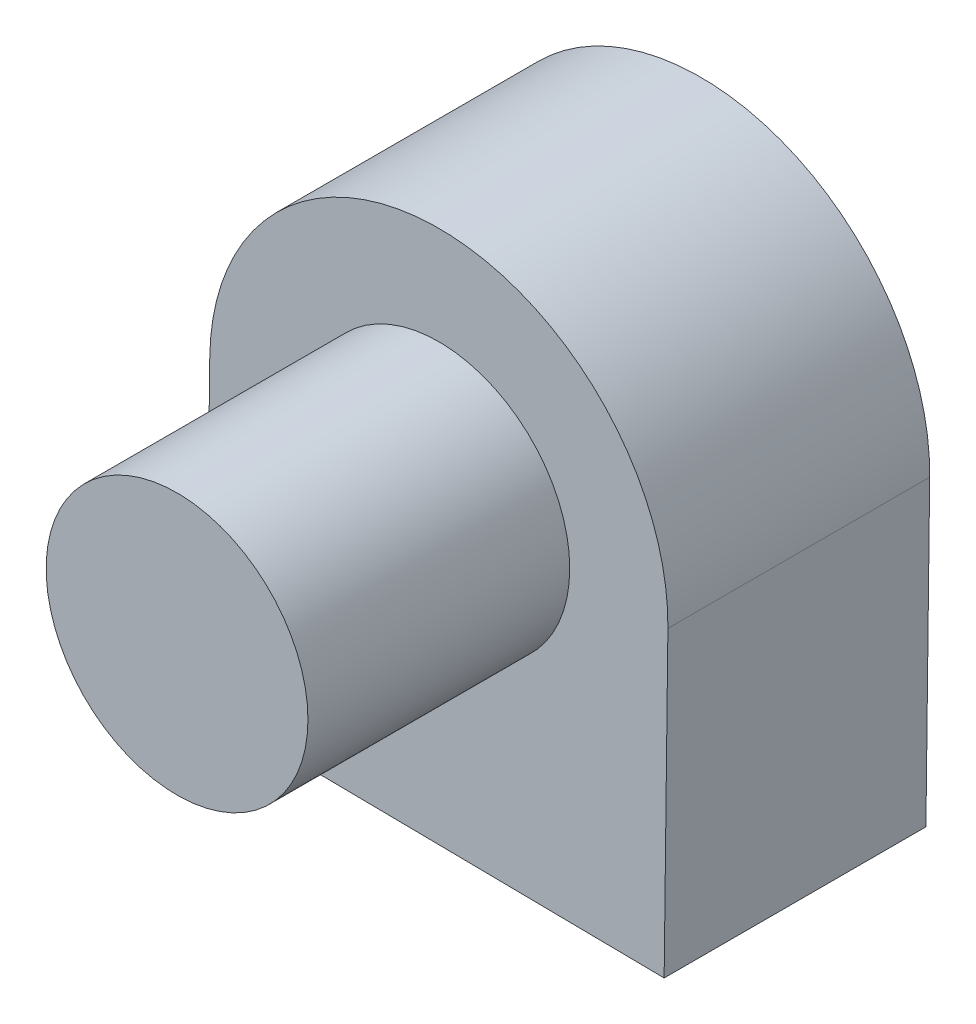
ISO-10303-21;
HEADER;
FILE_DESCRIPTION(('STEP AP214'),'2;1');
FILE_NAME('part.step','',(''),(''),'','','');
FILE_SCHEMA(('AUTOMOTIVE_DESIGN { 1 0 10303 214 1 1 1 1 }'));
ENDSEC;
DATA;
#1=APPLICATION_CONTEXT('core data for automotive mechanical design processes');
#2=APPLICATION_PROTOCOL_DEFINITION('international standard','automotive_design',2000,#1);
#3=PRODUCT_CONTEXT('',#1,'mechanical');
#4=PRODUCT('Part','Part','',(#3));
#5=PRODUCT_RELATED_PRODUCT_CATEGORY('part','',(#4));
#6=PRODUCT_DEFINITION_FORMATION('','',#4);
#7=PRODUCT_DEFINITION_CONTEXT('part definition',#1,'design');
#8=PRODUCT_DEFINITION('design','',#6,#7);
#9=PRODUCT_DEFINITION_SHAPE('','',#8);
#10=(LENGTH_UNIT() NAMED_UNIT(*) SI_UNIT(.MILLI.,.METRE.));
#11=(NAMED_UNIT(*) PLANE_ANGLE_UNIT() SI_UNIT($,.RADIAN.));
#12=(NAMED_UNIT(*) SI_UNIT($,.STERADIAN.) SOLID_ANGLE_UNIT());
#13=UNCERTAINTY_MEASURE_WITH_UNIT(LENGTH_MEASURE(1.E-05),#10,'distance_accuracy_value','');
#14=(GEOMETRIC_REPRESENTATION_CONTEXT(3) GLOBAL_UNCERTAINTY_ASSIGNED_CONTEXT((#13)) GLOBAL_UNIT_ASSIGNED_CONTEXT((#10,
#11,#12)) REPRESENTATION_CONTEXT('',''));
#15=CARTESIAN_POINT('',(0.,0.,0.));
#16=DIRECTION('',(0.,0.,1.));
#17=DIRECTION('',(1.,0.,0.));
#18=AXIS2_PLACEMENT_3D('',#15,#16,#17);
#19=CARTESIAN_POINT('',(13077.3616022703,5712.86470344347,-60.9728075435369));
#20=DIRECTION('',(4.96598459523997E-05,2.97959339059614E-06,0.999999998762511));
#21=DIRECTION('',(0.99999999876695,0.,-4.96598459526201E-05));
#22=AXIS2_PLACEMENT_3D('',#19,#20,#21);
#23=PLANE('',#22);
#24=DIRECTION('',(0.0123569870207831,0.999923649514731,-3.59301197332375E-06));
#25=VECTOR('',#24,1.);
#26=CARTESIAN_POINT('',(13076.9962605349,5683.30136079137,-60.9727013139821));
#27=LINE('',#26,#25);
#28=CARTESIAN_POINT('',(13076.9962605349,5683.30136079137,-60.9727013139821));
#29=VERTEX_POINT('',#28);
#30=CARTESIAN_POINT('',(13077.3616022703,5712.86470344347,-60.9728075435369));
#31=VERTEX_POINT('',#30);
#32=EDGE_CURVE('E70',#29,#31,#27,.T.);
#33=ORIENTED_EDGE('',*,*,#32,.F.);
#34=DIRECTION('',(0.999923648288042,-0.0123569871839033,-4.9619235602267E-05));
#35=VECTOR('',#34,1.);
#36=CARTESIAN_POINT('',(13032.5496543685,5683.8506288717,-60.9704957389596));
#37=LINE('',#36,#35);
#38=CARTESIAN_POINT('',(13032.5496543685,5683.8506288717,-60.9704957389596));
#39=VERTEX_POINT('',#38);
#40=EDGE_CURVE('E58',#39,#29,#37,.T.);
#41=ORIENTED_EDGE('',*,*,#40,.F.);
#42=DIRECTION('',(-0.012356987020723,-0.999923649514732,3.59301197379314E-06));
#43=VECTOR('',#42,1.);
#44=CARTESIAN_POINT('',(13032.9149961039,5713.41397152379,-60.9706019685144));
#45=LINE('',#44,#43);
#46=CARTESIAN_POINT('',(13032.9149961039,5713.41397152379,-60.9706019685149));
#47=VERTEX_POINT('',#46);
#48=EDGE_CURVE('E55',#47,#39,#45,.T.);
#49=ORIENTED_EDGE('',*,*,#48,.F.);
#50=CARTESIAN_POINT('',(13055.1382991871,5713.13933748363,-60.9717047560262));
#51=DIRECTION('',(-4.96598459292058E-05,-2.97959340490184E-06,-0.999999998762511));
#52=DIRECTION('',(-0.99999999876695,0.,4.96598459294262E-05));
#53=AXIS2_PLACEMENT_3D('',#50,#51,#52);
#54=CIRCLE('',#53,22.2249999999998);
#55=EDGE_CURVE('E18',#31,#47,#54,.F.);
#56=ORIENTED_EDGE('',*,*,#55,.F.);
#57=EDGE_LOOP('',(#33,#41,#49,#56));
#58=FACE_BOUND('',#57,.T.);
#59=ADVANCED_FACE('F14',(#58),#23,.F.);
#60=CARTESIAN_POINT('',(13032.915626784,5713.41400936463,-48.2706019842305));
#61=DIRECTION('',(-0.999923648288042,0.0123569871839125,4.96192356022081E-05));
#62=DIRECTION('',(-0.0123569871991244,-0.999923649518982,0.));
#63=AXIS2_PLACEMENT_3D('',#60,#61,#62);
#64=PLANE('',#63);
#65=DIRECTION('',(0.0123569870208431,0.99992364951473,-3.59301197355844E-06));
#66=VECTOR('',#65,1.);
#67=CARTESIAN_POINT('',(13032.5509157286,5683.85070455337,-35.5704957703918));
#68=LINE('',#67,#66);
#69=CARTESIAN_POINT('',(13032.5509157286,5683.85070455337,-35.5704957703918));
#70=VERTEX_POINT('',#69);
#71=CARTESIAN_POINT('',(13032.916257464,5713.41404720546,-35.5706019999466));
#72=VERTEX_POINT('',#71);
#73=EDGE_CURVE('E67',#70,#72,#68,.T.);
#74=ORIENTED_EDGE('',*,*,#73,.T.);
#75=DIRECTION('',(-4.96598459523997E-05,-2.97959339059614E-06,-0.999999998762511));
#76=VECTOR('',#75,1.);
#77=CARTESIAN_POINT('',(13032.915626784,5713.41400936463,-48.2706019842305));
#78=LINE('',#77,#76);
#79=EDGE_CURVE('E64',#47,#72,#78,.F.);
#80=ORIENTED_EDGE('',*,*,#79,.F.);
#81=ORIENTED_EDGE('',*,*,#48,.T.);
#82=DIRECTION('',(-4.96598458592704E-05,-2.97959340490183E-06,-0.999999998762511));
#83=VECTOR('',#82,1.);
#84=CARTESIAN_POINT('',(13032.5509157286,5683.85070455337,-35.5704957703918));
#85=LINE('',#84,#83);
#86=EDGE_CURVE('E89',#70,#39,#85,.T.);
#87=ORIENTED_EDGE('',*,*,#86,.F.);
#88=EDGE_LOOP('',(#74,#80,#81,#87));
#89=FACE_BOUND('',#88,.T.);
#90=ADVANCED_FACE('F65',(#89),#64,.T.);
#91=CARTESIAN_POINT('',(13055.1395605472,5713.1394131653,-35.5717047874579));
#92=DIRECTION('',(-4.96598459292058E-05,-2.97959340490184E-06,-0.999999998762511));
#93=DIRECTION('',(-0.99999999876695,0.,4.96598459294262E-05));
#94=AXIS2_PLACEMENT_3D('',#91,#92,#93);
#95=CYLINDRICAL_SURFACE('',#94,22.2249999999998);
#96=CARTESIAN_POINT('',(13055.1395605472,5713.1394131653,-35.5717047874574));
#97=DIRECTION('',(-4.96598459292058E-05,-2.97959340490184E-06,-0.999999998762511));
#98=DIRECTION('',(-0.99999999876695,0.,4.96598459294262E-05));
#99=AXIS2_PLACEMENT_3D('',#96,#97,#98);
#100=CIRCLE('',#99,22.2249999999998);
#101=CARTESIAN_POINT('',(13077.3628636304,5712.86477912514,-35.5728075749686));
#102=VERTEX_POINT('',#101);
#103=EDGE_CURVE('E75',#72,#102,#100,.T.);
#104=ORIENTED_EDGE('',*,*,#103,.T.);
#105=DIRECTION('',(4.96598459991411E-05,2.97959336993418E-06,0.999999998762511));
#106=VECTOR('',#105,1.);
#107=CARTESIAN_POINT('',(13077.3616022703,5712.86470344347,-60.9728075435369));
#108=LINE('',#107,#106);
#109=EDGE_CURVE('E73',#31,#102,#108,.T.);
#110=ORIENTED_EDGE('',*,*,#109,.F.);
#111=ORIENTED_EDGE('',*,*,#55,.T.);
#112=ORIENTED_EDGE('',*,*,#79,.T.);
#113=EDGE_LOOP('',(#104,#110,#111,#112));
#114=FACE_BOUND('',#113,.T.);
#115=ADVANCED_FACE('F72',(#114),#95,.T.);
#116=CARTESIAN_POINT('',(13076.9968912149,5683.30139863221,-48.2727013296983));
#117=DIRECTION('',(0.999923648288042,-0.0123569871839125,-4.96192356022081E-05));
#118=DIRECTION('',(0.0123569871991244,0.999923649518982,0.));
#119=AXIS2_PLACEMENT_3D('',#116,#117,#118);
#120=PLANE('',#119);
#121=DIRECTION('',(-0.012356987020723,-0.999923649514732,3.59301197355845E-06));
#122=VECTOR('',#121,1.);
#123=CARTESIAN_POINT('',(13077.3628636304,5712.86477912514,-35.5728075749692));
#124=LINE('',#123,#122);
#125=CARTESIAN_POINT('',(13076.997521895,5683.30143647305,-35.5727013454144));
#126=VERTEX_POINT('',#125);
#127=EDGE_CURVE('E33',#102,#126,#124,.T.);
#128=ORIENTED_EDGE('',*,*,#127,.T.);
#129=DIRECTION('',(4.96598458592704E-05,2.97959336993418E-06,0.999999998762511));
#130=VECTOR('',#129,1.);
#131=CARTESIAN_POINT('',(13076.9962605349,5683.30136079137,-60.9727013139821));
#132=LINE('',#131,#130);
#133=EDGE_CURVE('E78',#29,#126,#132,.T.);
#134=ORIENTED_EDGE('',*,*,#133,.F.);
#135=ORIENTED_EDGE('',*,*,#32,.T.);
#136=ORIENTED_EDGE('',*,*,#109,.T.);
#137=EDGE_LOOP('',(#128,#134,#135,#136));
#138=FACE_BOUND('',#137,.T.);
#139=ADVANCED_FACE('F77',(#138),#120,.T.);
#140=CARTESIAN_POINT('',(13032.5502850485,5683.85066671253,-48.2704957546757));
#141=DIRECTION('',(-0.0123569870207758,-0.999923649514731,3.5930119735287E-06));
#142=DIRECTION('',(0.999923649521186,-0.0123569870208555,0.));
#143=AXIS2_PLACEMENT_3D('',#140,#141,#142);
#144=PLANE('',#143);
#145=DIRECTION('',(-0.999923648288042,0.0123569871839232,4.9619235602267E-05));
#146=VECTOR('',#145,1.);
#147=CARTESIAN_POINT('',(13076.997521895,5683.30143647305,-35.5727013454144));
#148=LINE('',#147,#146);
#149=EDGE_CURVE('E87',#126,#70,#148,.T.);
#150=ORIENTED_EDGE('',*,*,#149,.T.);
#151=ORIENTED_EDGE('',*,*,#86,.T.);
#152=ORIENTED_EDGE('',*,*,#40,.T.);
#153=ORIENTED_EDGE('',*,*,#133,.T.);
#154=EDGE_LOOP('',(#150,#151,#152,#153));
#155=FACE_BOUND('',#154,.T.);
#156=ADVANCED_FACE('F108',(#155),#144,.T.);
#157=CARTESIAN_POINT('',(13076.997521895,5683.30143647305,-35.5727013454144));
#158=DIRECTION('',(-4.96598459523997E-05,-2.97959339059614E-06,-0.999999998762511));
#159=DIRECTION('',(-0.99999999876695,0.,4.96598459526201E-05));
#160=AXIS2_PLACEMENT_3D('',#157,#158,#159);
#161=PLANE('',#160);
#162=ORIENTED_EDGE('',*,*,#127,.F.);
#163=ORIENTED_EDGE('',*,*,#103,.F.);
#164=ORIENTED_EDGE('',*,*,#73,.F.);
#165=ORIENTED_EDGE('',*,*,#149,.F.);
#166=EDGE_LOOP('',(#162,#163,#164,#165));
#167=FACE_BOUND('',#166,.T.);
#168=CARTESIAN_POINT('',(13055.1395605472,5713.1394131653,-35.5717047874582));
#169=DIRECTION('',(4.96598459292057E-05,2.97959340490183E-06,0.999999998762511));
#170=DIRECTION('',(0.99999999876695,0.,-4.96598459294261E-05));
#171=AXIS2_PLACEMENT_3D('',#168,#169,#170);
#172=CIRCLE('',#171,12.6999999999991);
#173=CARTESIAN_POINT('',(13067.8395605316,5713.1394131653,-35.5723354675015));
#174=VERTEX_POINT('',#173);
#175=EDGE_CURVE('E24',#174,#174,#172,.T.);
#176=ORIENTED_EDGE('',*,*,#175,.F.);
#177=EDGE_LOOP('',(#176));
#178=FACE_BOUND('',#177,.T.);
#179=ADVANCED_FACE('F111',(#167,#178),#161,.F.);
#180=CARTESIAN_POINT('',(13067.8398522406,5712.98255510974,-10.1723349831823));
#181=DIRECTION('',(4.96598459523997E-05,2.97959339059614E-06,0.999999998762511));
#182=DIRECTION('',(0.99999999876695,0.,-4.96598459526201E-05));
#183=AXIS2_PLACEMENT_3D('',#180,#181,#182);
#184=PLANE('',#183);
#185=CARTESIAN_POINT('',(13055.1408219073,5713.13948884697,-10.1717048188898));
#186=DIRECTION('',(4.96598459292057E-05,2.97959340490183E-06,0.999999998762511));
#187=DIRECTION('',(0.99999999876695,0.,-4.96598459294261E-05));
#188=AXIS2_PLACEMENT_3D('',#185,#186,#187);
#189=CIRCLE('',#188,12.6999999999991);
#190=CARTESIAN_POINT('',(13067.8408218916,5713.13948884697,-10.1723354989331));
#191=VERTEX_POINT('',#190);
#192=EDGE_CURVE('E9',#191,#191,#189,.F.);
#193=ORIENTED_EDGE('',*,*,#192,.F.);
#194=EDGE_LOOP('',(#193));
#195=FACE_BOUND('',#194,.T.);
#196=ADVANCED_FACE('F114',(#195),#184,.T.);
#197=CARTESIAN_POINT('',(13055.1395605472,5713.1394131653,-35.5717047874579));
#198=DIRECTION('',(4.96598459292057E-05,2.97959340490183E-06,0.999999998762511));
#199=DIRECTION('',(0.99999999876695,0.,-4.96598459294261E-05));
#200=AXIS2_PLACEMENT_3D('',#197,#198,#199);
#201=CYLINDRICAL_SURFACE('',#200,12.6999999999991);
#202=ORIENTED_EDGE('',*,*,#175,.T.);
#203=EDGE_LOOP('',(#202));
#204=FACE_BOUND('',#203,.T.);
#205=ORIENTED_EDGE('',*,*,#192,.T.);
#206=EDGE_LOOP('',(#205));
#207=FACE_BOUND('',#206,.T.);
#208=ADVANCED_FACE('F16',(#204,#207),#201,.T.);
#209=CLOSED_SHELL('',(#59,#90,#115,#139,#156,#179,#196,#208));
#210=MANIFOLD_SOLID_BREP('B1',#209);
#211=ADVANCED_BREP_SHAPE_REPRESENTATION('',(#18,#210),#14);
#212=SHAPE_DEFINITION_REPRESENTATION(#9,#211);
ENDSEC;
END-ISO-10303-21;
